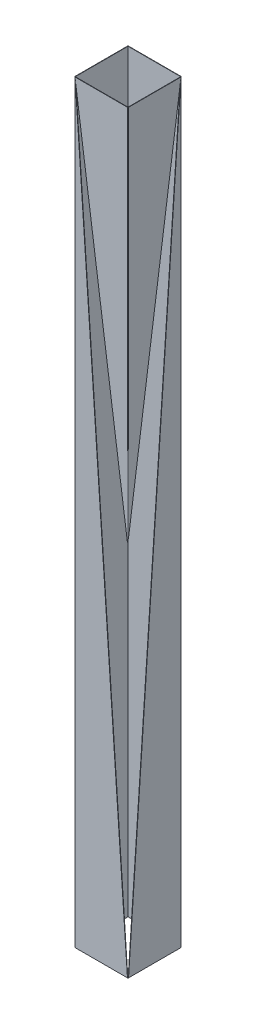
ISO-10303-21;
HEADER;
FILE_DESCRIPTION(('STEP AP214'),'2;1');
FILE_NAME('part.step','',(''),(''),'','','');
FILE_SCHEMA(('AUTOMOTIVE_DESIGN { 1 0 10303 214 1 1 1 1 }'));
ENDSEC;
DATA;
#1=APPLICATION_CONTEXT('core data for automotive mechanical design processes');
#2=APPLICATION_PROTOCOL_DEFINITION('international standard','automotive_design',2000,#1);
#3=PRODUCT_CONTEXT('',#1,'mechanical');
#4=PRODUCT('Part','Part','',(#3));
#5=PRODUCT_RELATED_PRODUCT_CATEGORY('part','',(#4));
#6=PRODUCT_DEFINITION_FORMATION('','',#4);
#7=PRODUCT_DEFINITION_CONTEXT('part definition',#1,'design');
#8=PRODUCT_DEFINITION('design','',#6,#7);
#9=PRODUCT_DEFINITION_SHAPE('','',#8);
#10=(LENGTH_UNIT() NAMED_UNIT(*) SI_UNIT(.MILLI.,.METRE.));
#11=(NAMED_UNIT(*) PLANE_ANGLE_UNIT() SI_UNIT($,.RADIAN.));
#12=(NAMED_UNIT(*) SI_UNIT($,.STERADIAN.) SOLID_ANGLE_UNIT());
#13=UNCERTAINTY_MEASURE_WITH_UNIT(LENGTH_MEASURE(1.E-05),#10,'distance_accuracy_value','');
#14=(GEOMETRIC_REPRESENTATION_CONTEXT(3) GLOBAL_UNCERTAINTY_ASSIGNED_CONTEXT((#13)) GLOBAL_UNIT_ASSIGNED_CONTEXT((#10,
#11,#12)) REPRESENTATION_CONTEXT('',''));
#15=CARTESIAN_POINT('',(0.,0.,0.));
#16=DIRECTION('',(0.,0.,1.));
#17=DIRECTION('',(1.,0.,0.));
#18=AXIS2_PLACEMENT_3D('',#15,#16,#17);
#19=CARTESIAN_POINT('',(140.,2000.,141.999999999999));
#20=DIRECTION('',(0.,0.,-1.));
#21=DIRECTION('',(-1.,0.,0.));
#22=AXIS2_PLACEMENT_3D('',#19,#20,#21);
#23=PLANE('',#22);
#24=DIRECTION('',(0.,-1.,0.));
#25=VECTOR('',#24,1.);
#26=CARTESIAN_POINT('',(139.5,2000.,141.999999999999));
#27=LINE('',#26,#25);
#28=CARTESIAN_POINT('',(139.5,0.99999999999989,141.999999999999));
#29=VERTEX_POINT('',#28);
#30=CARTESIAN_POINT('',(139.5,0.,141.999999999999));
#31=VERTEX_POINT('',#30);
#32=EDGE_CURVE('E68',#29,#31,#27,.T.);
#33=ORIENTED_EDGE('',*,*,#32,.F.);
#34=DIRECTION('',(0.0694018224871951,-0.997588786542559,0.));
#35=VECTOR('',#34,1.);
#36=CARTESIAN_POINT('',(139.5,0.999999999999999,142.));
#37=LINE('',#36,#35);
#38=CARTESIAN_POINT('',(0.499999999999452,1999.,142.));
#39=VERTEX_POINT('',#38);
#40=EDGE_CURVE('E530',#39,#29,#37,.T.);
#41=ORIENTED_EDGE('',*,*,#40,.F.);
#42=DIRECTION('',(0.,-1.,0.));
#43=VECTOR('',#42,1.);
#44=CARTESIAN_POINT('',(0.499999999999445,2000.,142.));
#45=LINE('',#44,#43);
#46=CARTESIAN_POINT('',(0.499999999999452,0.,142.));
#47=VERTEX_POINT('',#46);
#48=EDGE_CURVE('E534',#39,#47,#45,.T.);
#49=ORIENTED_EDGE('',*,*,#48,.T.);
#50=DIRECTION('',(1.,0.,0.));
#51=VECTOR('',#50,1.);
#52=CARTESIAN_POINT('',(140.,0.,141.999999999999));
#53=LINE('',#52,#51);
#54=EDGE_CURVE('E593',#47,#31,#53,.T.);
#55=ORIENTED_EDGE('',*,*,#54,.T.);
#56=EDGE_LOOP('',(#33,#41,#49,#55));
#57=FACE_BOUND('',#56,.T.);
#58=ADVANCED_FACE('F43',(#57),#23,.F.);
#59=CARTESIAN_POINT('',(140.,2000.,140.999999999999));
#60=DIRECTION('',(0.,0.,-1.));
#61=DIRECTION('',(-1.,0.,0.));
#62=AXIS2_PLACEMENT_3D('',#59,#60,#61);
#63=PLANE('',#62);
#64=DIRECTION('',(0.0694018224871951,-0.997588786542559,0.));
#65=VECTOR('',#64,1.);
#66=CARTESIAN_POINT('',(139.5,0.999999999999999,141.));
#67=LINE('',#66,#65);
#68=CARTESIAN_POINT('',(0.499999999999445,1999.,141.));
#69=VERTEX_POINT('',#68);
#70=CARTESIAN_POINT('',(139.5,0.99999999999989,140.999999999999));
#71=VERTEX_POINT('',#70);
#72=EDGE_CURVE('E546',#69,#71,#67,.T.);
#73=ORIENTED_EDGE('',*,*,#72,.T.);
#74=DIRECTION('',(0.,1.,0.));
#75=VECTOR('',#74,1.);
#76=CARTESIAN_POINT('',(139.5,0.,140.999999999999));
#77=LINE('',#76,#75);
#78=CARTESIAN_POINT('',(139.5,0.,140.999999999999));
#79=VERTEX_POINT('',#78);
#80=EDGE_CURVE('E582',#79,#71,#77,.T.);
#81=ORIENTED_EDGE('',*,*,#80,.F.);
#82=DIRECTION('',(1.,0.,0.));
#83=VECTOR('',#82,1.);
#84=CARTESIAN_POINT('',(140.,0.,140.999999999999));
#85=LINE('',#84,#83);
#86=CARTESIAN_POINT('',(0.499999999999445,0.,141.));
#87=VERTEX_POINT('',#86);
#88=EDGE_CURVE('E597',#87,#79,#85,.T.);
#89=ORIENTED_EDGE('',*,*,#88,.F.);
#90=DIRECTION('',(0.,-1.,0.));
#91=VECTOR('',#90,1.);
#92=CARTESIAN_POINT('',(0.499999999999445,2000.,141.));
#93=LINE('',#92,#91);
#94=EDGE_CURVE('E535',#69,#87,#93,.T.);
#95=ORIENTED_EDGE('',*,*,#94,.F.);
#96=EDGE_LOOP('',(#73,#81,#89,#95));
#97=FACE_BOUND('',#96,.T.);
#98=ADVANCED_FACE('F662',(#97),#63,.T.);
#99=CARTESIAN_POINT('',(-4.9960036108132E-13,2000.,142.));
#100=DIRECTION('',(0.,-1.,0.));
#101=DIRECTION('',(0.,0.,-1.));
#102=AXIS2_PLACEMENT_3D('',#99,#100,#101);
#103=PLANE('',#102);
#104=DIRECTION('',(0.,0.,1.));
#105=VECTOR('',#104,1.);
#106=CARTESIAN_POINT('',(0.499999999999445,2000.,141.));
#107=LINE('',#106,#105);
#108=CARTESIAN_POINT('',(0.499999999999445,2000.,141.));
#109=VERTEX_POINT('',#108);
#110=CARTESIAN_POINT('',(0.499999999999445,2000.,142.));
#111=VERTEX_POINT('',#110);
#112=EDGE_CURVE('E12',#109,#111,#107,.T.);
#113=ORIENTED_EDGE('',*,*,#112,.T.);
#114=DIRECTION('',(-1.,0.,0.));
#115=VECTOR('',#114,1.);
#116=CARTESIAN_POINT('',(-4.9960036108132E-13,2000.,142.));
#117=LINE('',#116,#115);
#118=CARTESIAN_POINT('',(139.5,2000.,141.999999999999));
#119=VERTEX_POINT('',#118);
#120=EDGE_CURVE('E568',#119,#111,#117,.T.);
#121=ORIENTED_EDGE('',*,*,#120,.F.);
#122=DIRECTION('',(0.,0.,1.));
#123=VECTOR('',#122,1.);
#124=CARTESIAN_POINT('',(139.5,2000.,140.999999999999));
#125=LINE('',#124,#123);
#126=CARTESIAN_POINT('',(139.5,2000.,140.999999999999));
#127=VERTEX_POINT('',#126);
#128=EDGE_CURVE('E525',#127,#119,#125,.T.);
#129=ORIENTED_EDGE('',*,*,#128,.F.);
#130=DIRECTION('',(-1.,0.,0.));
#131=VECTOR('',#130,1.);
#132=CARTESIAN_POINT('',(-4.9960036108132E-13,2000.,141.));
#133=LINE('',#132,#131);
#134=EDGE_CURVE('E545',#127,#109,#133,.T.);
#135=ORIENTED_EDGE('',*,*,#134,.T.);
#136=EDGE_LOOP('',(#113,#121,#129,#135));
#137=FACE_BOUND('',#136,.T.);
#138=ADVANCED_FACE('F45',(#137),#103,.F.);
#139=CARTESIAN_POINT('',(140.,0.,141.999999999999));
#140=DIRECTION('',(0.,1.,0.));
#141=DIRECTION('',(0.,0.,1.));
#142=AXIS2_PLACEMENT_3D('',#139,#140,#141);
#143=PLANE('',#142);
#144=DIRECTION('',(0.,0.,1.));
#145=VECTOR('',#144,1.);
#146=CARTESIAN_POINT('',(0.499999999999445,0.,141.));
#147=LINE('',#146,#145);
#148=EDGE_CURVE('E533',#87,#47,#147,.T.);
#149=ORIENTED_EDGE('',*,*,#148,.F.);
#150=ORIENTED_EDGE('',*,*,#88,.T.);
#151=DIRECTION('',(0.,0.,1.));
#152=VECTOR('',#151,1.);
#153=CARTESIAN_POINT('',(139.5,0.,140.999999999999));
#154=LINE('',#153,#152);
#155=EDGE_CURVE('E539',#79,#31,#154,.T.);
#156=ORIENTED_EDGE('',*,*,#155,.T.);
#157=ORIENTED_EDGE('',*,*,#54,.F.);
#158=EDGE_LOOP('',(#149,#150,#156,#157));
#159=FACE_BOUND('',#158,.T.);
#160=ADVANCED_FACE('F697',(#159),#143,.F.);
#161=DIRECTION('',(0.,-1.,0.));
#162=VECTOR('',#161,1.);
#163=CARTESIAN_POINT('',(0.499999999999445,2000.,142.));
#164=LINE('',#163,#162);
#165=EDGE_CURVE('E52',#111,#39,#164,.T.);
#166=ORIENTED_EDGE('',*,*,#165,.T.);
#167=DIRECTION('',(-0.137811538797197,0.990458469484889,0.));
#168=VECTOR('',#167,1.);
#169=CARTESIAN_POINT('',(139.5,1000.,142.));
#170=LINE('',#169,#168);
#171=CARTESIAN_POINT('',(139.5,1000.,142.));
#172=VERTEX_POINT('',#171);
#173=EDGE_CURVE('E351',#172,#39,#170,.T.);
#174=ORIENTED_EDGE('',*,*,#173,.F.);
#175=DIRECTION('',(0.,-1.,0.));
#176=VECTOR('',#175,1.);
#177=CARTESIAN_POINT('',(139.5,2000.,141.999999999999));
#178=LINE('',#177,#176);
#179=EDGE_CURVE('E516',#119,#172,#178,.T.);
#180=ORIENTED_EDGE('',*,*,#179,.F.);
#181=ORIENTED_EDGE('',*,*,#120,.T.);
#182=EDGE_LOOP('',(#166,#174,#180,#181));
#183=FACE_BOUND('',#182,.T.);
#184=ADVANCED_FACE('F507',(#183),#23,.F.);
#185=DIRECTION('',(-0.137811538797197,0.990458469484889,0.));
#186=VECTOR('',#185,1.);
#187=CARTESIAN_POINT('',(139.5,1000.,141.));
#188=LINE('',#187,#186);
#189=CARTESIAN_POINT('',(139.5,1000.,141.));
#190=VERTEX_POINT('',#189);
#191=EDGE_CURVE('E551',#190,#69,#188,.T.);
#192=ORIENTED_EDGE('',*,*,#191,.T.);
#193=DIRECTION('',(0.,-1.,0.));
#194=VECTOR('',#193,1.);
#195=CARTESIAN_POINT('',(0.499999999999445,2000.,141.));
#196=LINE('',#195,#194);
#197=EDGE_CURVE('E537',#109,#69,#196,.T.);
#198=ORIENTED_EDGE('',*,*,#197,.F.);
#199=ORIENTED_EDGE('',*,*,#134,.F.);
#200=DIRECTION('',(0.,1.,0.));
#201=VECTOR('',#200,1.);
#202=CARTESIAN_POINT('',(139.5,0.,140.999999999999));
#203=LINE('',#202,#201);
#204=EDGE_CURVE('E590',#190,#127,#203,.T.);
#205=ORIENTED_EDGE('',*,*,#204,.F.);
#206=EDGE_LOOP('',(#192,#198,#199,#205));
#207=FACE_BOUND('',#206,.T.);
#208=ADVANCED_FACE('F501',(#207),#63,.T.);
#209=CARTESIAN_POINT('',(139.5,0.999999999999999,141.));
#210=DIRECTION('',(-0.997588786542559,-0.0694018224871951,0.));
#211=DIRECTION('',(-0.0694018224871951,0.997588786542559,0.));
#212=AXIS2_PLACEMENT_3D('',#209,#210,#211);
#213=PLANE('',#212);
#214=ORIENTED_EDGE('',*,*,#40,.T.);
#215=DIRECTION('',(0.,0.,1.));
#216=VECTOR('',#215,1.);
#217=CARTESIAN_POINT('',(139.5,0.999999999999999,141.));
#218=LINE('',#217,#216);
#219=EDGE_CURVE('E601',#71,#29,#218,.T.);
#220=ORIENTED_EDGE('',*,*,#219,.F.);
#221=ORIENTED_EDGE('',*,*,#72,.F.);
#222=DIRECTION('',(0.,0.,1.));
#223=VECTOR('',#222,1.);
#224=CARTESIAN_POINT('',(0.499999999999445,1999.,141.));
#225=LINE('',#224,#223);
#226=EDGE_CURVE('E542',#69,#39,#225,.T.);
#227=ORIENTED_EDGE('',*,*,#226,.T.);
#228=EDGE_LOOP('',(#214,#220,#221,#227));
#229=FACE_BOUND('',#228,.T.);
#230=ADVANCED_FACE('F497',(#229),#213,.F.);
#231=CARTESIAN_POINT('',(139.5,1000.,141.));
#232=DIRECTION('',(0.990458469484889,0.137811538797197,0.));
#233=DIRECTION('',(0.137811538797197,-0.990458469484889,0.));
#234=AXIS2_PLACEMENT_3D('',#231,#232,#233);
#235=PLANE('',#234);
#236=ORIENTED_EDGE('',*,*,#173,.T.);
#237=ORIENTED_EDGE('',*,*,#226,.F.);
#238=ORIENTED_EDGE('',*,*,#191,.F.);
#239=CARTESIAN_POINT('',(139.5,1000.,141.999999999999));
#240=CARTESIAN_POINT('',(139.5,1000.,140.999999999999));
#241=B_SPLINE_CURVE_WITH_KNOTS('',1,(#239,#240),.UNSPECIFIED.,.F.,.F.,(2,2),(0.,1.),.UNSPECIFIED.);
#242=EDGE_CURVE('E524',#190,#172,#241,.F.);
#243=ORIENTED_EDGE('',*,*,#242,.T.);
#244=EDGE_LOOP('',(#236,#237,#238,#243));
#245=FACE_BOUND('',#244,.T.);
#246=ADVANCED_FACE('F500',(#245),#235,.F.);
#247=CARTESIAN_POINT('',(0.,0.,1.));
#248=DIRECTION('',(1.,0.,0.));
#249=DIRECTION('',(0.,0.,-1.));
#250=AXIS2_PLACEMENT_3D('',#247,#248,#249);
#251=PLANE('',#250);
#252=DIRECTION('',(0.,-1.,0.));
#253=VECTOR('',#252,1.);
#254=CARTESIAN_POINT('',(0.,0.,0.));
#255=LINE('',#254,#253);
#256=CARTESIAN_POINT('',(0.,2000.,0.));
#257=VERTEX_POINT('',#256);
#258=CARTESIAN_POINT('',(0.,0.,0.));
#259=VERTEX_POINT('',#258);
#260=EDGE_CURVE('E459',#257,#259,#255,.T.);
#261=ORIENTED_EDGE('',*,*,#260,.T.);
#262=DIRECTION('',(0.,0.,-1.));
#263=VECTOR('',#262,1.);
#264=CARTESIAN_POINT('',(0.,0.,1.));
#265=LINE('',#264,#263);
#266=CARTESIAN_POINT('',(0.,0.,1.));
#267=VERTEX_POINT('',#266);
#268=EDGE_CURVE('E453',#267,#259,#265,.T.);
#269=ORIENTED_EDGE('',*,*,#268,.F.);
#270=DIRECTION('',(0.,-1.,0.));
#271=VECTOR('',#270,1.);
#272=CARTESIAN_POINT('',(0.,0.,1.));
#273=LINE('',#272,#271);
#274=CARTESIAN_POINT('',(0.,2000.,1.));
#275=VERTEX_POINT('',#274);
#276=EDGE_CURVE('E437',#275,#267,#273,.T.);
#277=ORIENTED_EDGE('',*,*,#276,.F.);
#278=DIRECTION('',(0.,0.,-1.));
#279=VECTOR('',#278,1.);
#280=CARTESIAN_POINT('',(0.,2000.,1.));
#281=LINE('',#280,#279);
#282=EDGE_CURVE('E456',#275,#257,#281,.T.);
#283=ORIENTED_EDGE('',*,*,#282,.T.);
#284=EDGE_LOOP('',(#261,#269,#277,#283));
#285=FACE_BOUND('',#284,.T.);
#286=ADVANCED_FACE('F315',(#285),#251,.F.);
#287=CARTESIAN_POINT('',(0.,0.,1.));
#288=DIRECTION('',(0.,1.,0.));
#289=DIRECTION('',(0.,0.,1.));
#290=AXIS2_PLACEMENT_3D('',#287,#288,#289);
#291=PLANE('',#290);
#292=DIRECTION('',(0.,0.,-1.));
#293=VECTOR('',#292,1.);
#294=CARTESIAN_POINT('',(139.5,0.,1.));
#295=LINE('',#294,#293);
#296=CARTESIAN_POINT('',(139.5,0.,1.));
#297=VERTEX_POINT('',#296);
#298=CARTESIAN_POINT('',(139.5,0.,0.));
#299=VERTEX_POINT('',#298);
#300=EDGE_CURVE('E427',#297,#299,#295,.T.);
#301=ORIENTED_EDGE('',*,*,#300,.F.);
#302=DIRECTION('',(1.,0.,0.));
#303=VECTOR('',#302,1.);
#304=CARTESIAN_POINT('',(0.,0.,1.));
#305=LINE('',#304,#303);
#306=EDGE_CURVE('E434',#267,#297,#305,.T.);
#307=ORIENTED_EDGE('',*,*,#306,.F.);
#308=ORIENTED_EDGE('',*,*,#268,.T.);
#309=DIRECTION('',(1.,0.,0.));
#310=VECTOR('',#309,1.);
#311=CARTESIAN_POINT('',(0.,0.,0.));
#312=LINE('',#311,#310);
#313=EDGE_CURVE('E450',#259,#299,#312,.T.);
#314=ORIENTED_EDGE('',*,*,#313,.T.);
#315=EDGE_LOOP('',(#301,#307,#308,#314));
#316=FACE_BOUND('',#315,.T.);
#317=ADVANCED_FACE('F945',(#316),#291,.F.);
#318=CARTESIAN_POINT('',(0.,2000.,0.));
#319=DIRECTION('',(0.,0.,-1.));
#320=DIRECTION('',(-1.,0.,0.));
#321=AXIS2_PLACEMENT_3D('',#318,#319,#320);
#322=PLANE('',#321);
#323=DIRECTION('',(-1.,0.,0.));
#324=VECTOR('',#323,1.);
#325=CARTESIAN_POINT('',(0.,2000.,0.));
#326=LINE('',#325,#324);
#327=CARTESIAN_POINT('',(139.5,2000.,0.));
#328=VERTEX_POINT('',#327);
#329=EDGE_CURVE('E442',#328,#257,#326,.T.);
#330=ORIENTED_EDGE('',*,*,#329,.F.);
#331=DIRECTION('',(0.,-1.,0.));
#332=VECTOR('',#331,1.);
#333=CARTESIAN_POINT('',(139.5,2000.,0.));
#334=LINE('',#333,#332);
#335=EDGE_CURVE('E447',#328,#299,#334,.T.);
#336=ORIENTED_EDGE('',*,*,#335,.T.);
#337=ORIENTED_EDGE('',*,*,#313,.F.);
#338=ORIENTED_EDGE('',*,*,#260,.F.);
#339=EDGE_LOOP('',(#330,#336,#337,#338));
#340=FACE_BOUND('',#339,.T.);
#341=ADVANCED_FACE('F935',(#340),#322,.T.);
#342=CARTESIAN_POINT('',(0.,2000.,1.));
#343=DIRECTION('',(0.,-1.,0.));
#344=DIRECTION('',(0.,0.,-1.));
#345=AXIS2_PLACEMENT_3D('',#342,#343,#344);
#346=PLANE('',#345);
#347=DIRECTION('',(0.,0.,-1.));
#348=VECTOR('',#347,1.);
#349=CARTESIAN_POINT('',(139.5,2000.,1.));
#350=LINE('',#349,#348);
#351=CARTESIAN_POINT('',(139.5,2000.,1.));
#352=VERTEX_POINT('',#351);
#353=EDGE_CURVE('E444',#352,#328,#350,.T.);
#354=ORIENTED_EDGE('',*,*,#353,.T.);
#355=ORIENTED_EDGE('',*,*,#329,.T.);
#356=ORIENTED_EDGE('',*,*,#282,.F.);
#357=DIRECTION('',(-1.,0.,0.));
#358=VECTOR('',#357,1.);
#359=CARTESIAN_POINT('',(0.,2000.,1.));
#360=LINE('',#359,#358);
#361=EDGE_CURVE('E440',#352,#275,#360,.T.);
#362=ORIENTED_EDGE('',*,*,#361,.F.);
#363=EDGE_LOOP('',(#354,#355,#356,#362));
#364=FACE_BOUND('',#363,.T.);
#365=ADVANCED_FACE('F925',(#364),#346,.F.);
#366=CARTESIAN_POINT('',(0.,2000.,1.));
#367=DIRECTION('',(0.,0.,-1.));
#368=DIRECTION('',(-1.,0.,0.));
#369=AXIS2_PLACEMENT_3D('',#366,#367,#368);
#370=PLANE('',#369);
#371=DIRECTION('',(0.,-1.,0.));
#372=VECTOR('',#371,1.);
#373=CARTESIAN_POINT('',(139.5,2000.,1.));
#374=LINE('',#373,#372);
#375=EDGE_CURVE('E412',#352,#297,#374,.T.);
#376=ORIENTED_EDGE('',*,*,#375,.F.);
#377=ORIENTED_EDGE('',*,*,#361,.T.);
#378=ORIENTED_EDGE('',*,*,#276,.T.);
#379=ORIENTED_EDGE('',*,*,#306,.T.);
#380=EDGE_LOOP('',(#376,#377,#378,#379));
#381=FACE_BOUND('',#380,.T.);
#382=ADVANCED_FACE('F916',(#381),#370,.F.);
#383=CARTESIAN_POINT('',(139.5,0.,1.5));
#384=DIRECTION('',(0.,1.,0.));
#385=DIRECTION('',(0.,0.,1.));
#386=AXIS2_PLACEMENT_3D('',#383,#384,#385);
#387=PLANE('',#386);
#388=CARTESIAN_POINT('',(139.5,0.,1.5));
#389=DIRECTION('',(0.,1.,0.));
#390=DIRECTION('',(0.,0.,1.));
#391=AXIS2_PLACEMENT_3D('',#388,#389,#390);
#392=CIRCLE('',#391,1.5);
#393=CARTESIAN_POINT('',(140.999999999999,0.,1.499999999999));
#394=VERTEX_POINT('',#393);
#395=EDGE_CURVE('E431',#299,#394,#392,.F.);
#396=ORIENTED_EDGE('',*,*,#395,.T.);
#397=DIRECTION('',(1.,0.,0.));
#398=VECTOR('',#397,1.);
#399=CARTESIAN_POINT('',(139.999999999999,0.,1.499999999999));
#400=LINE('',#399,#398);
#401=CARTESIAN_POINT('',(139.999999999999,0.,1.499999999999));
#402=VERTEX_POINT('',#401);
#403=EDGE_CURVE('E343',#402,#394,#400,.T.);
#404=ORIENTED_EDGE('',*,*,#403,.F.);
#405=CARTESIAN_POINT('',(139.5,0.,1.5));
#406=DIRECTION('',(0.,-1.,0.));
#407=DIRECTION('',(0.,0.,-1.));
#408=AXIS2_PLACEMENT_3D('',#405,#406,#407);
#409=CIRCLE('',#408,0.5);
#410=EDGE_CURVE('E407',#297,#402,#409,.T.);
#411=ORIENTED_EDGE('',*,*,#410,.F.);
#412=ORIENTED_EDGE('',*,*,#300,.T.);
#413=EDGE_LOOP('',(#396,#404,#411,#412));
#414=FACE_BOUND('',#413,.T.);
#415=ADVANCED_FACE('F649',(#414),#387,.F.);
#416=CARTESIAN_POINT('',(139.5,-1000.00086685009,1.5));
#417=DIRECTION('',(0.,1.,0.));
#418=DIRECTION('',(0.,0.,1.));
#419=AXIS2_PLACEMENT_3D('',#416,#417,#418);
#420=CYLINDRICAL_SURFACE('',#419,1.5);
#421=ORIENTED_EDGE('',*,*,#335,.F.);
#422=CARTESIAN_POINT('',(139.5,2000.,1.5));
#423=DIRECTION('',(0.,1.,0.));
#424=DIRECTION('',(0.,0.,1.));
#425=AXIS2_PLACEMENT_3D('',#422,#423,#424);
#426=CIRCLE('',#425,1.5);
#427=CARTESIAN_POINT('',(140.999999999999,2000.,1.499999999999));
#428=VERTEX_POINT('',#427);
#429=EDGE_CURVE('E414',#428,#328,#426,.T.);
#430=ORIENTED_EDGE('',*,*,#429,.F.);
#431=DIRECTION('',(0.,-1.,0.));
#432=VECTOR('',#431,1.);
#433=CARTESIAN_POINT('',(140.999999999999,0.,1.499999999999));
#434=LINE('',#433,#432);
#435=CARTESIAN_POINT('',(141.,1999.,1.499999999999));
#436=VERTEX_POINT('',#435);
#437=EDGE_CURVE('E422',#428,#436,#434,.T.);
#438=ORIENTED_EDGE('',*,*,#437,.T.);
#439=DIRECTION('',(0.,-1.,0.));
#440=VECTOR('',#439,1.);
#441=CARTESIAN_POINT('',(140.999999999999,0.,1.499999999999));
#442=LINE('',#441,#440);
#443=EDGE_CURVE('E419',#436,#394,#442,.T.);
#444=ORIENTED_EDGE('',*,*,#443,.T.);
#445=ORIENTED_EDGE('',*,*,#395,.F.);
#446=EDGE_LOOP('',(#421,#430,#438,#444,#445));
#447=FACE_BOUND('',#446,.T.);
#448=ADVANCED_FACE('F630',(#447),#420,.T.);
#449=CARTESIAN_POINT('',(139.5,2000.,1.5));
#450=DIRECTION('',(0.,-1.,0.));
#451=DIRECTION('',(0.,0.,-1.));
#452=AXIS2_PLACEMENT_3D('',#449,#450,#451);
#453=PLANE('',#452);
#454=DIRECTION('',(1.,0.,0.));
#455=VECTOR('',#454,1.);
#456=CARTESIAN_POINT('',(139.999999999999,2000.,1.499999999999));
#457=LINE('',#456,#455);
#458=CARTESIAN_POINT('',(140.,2000.,1.5));
#459=VERTEX_POINT('',#458);
#460=EDGE_CURVE('E416',#459,#428,#457,.T.);
#461=ORIENTED_EDGE('',*,*,#460,.T.);
#462=ORIENTED_EDGE('',*,*,#429,.T.);
#463=ORIENTED_EDGE('',*,*,#353,.F.);
#464=CARTESIAN_POINT('',(139.5,2000.,1.5));
#465=DIRECTION('',(0.,1.,0.));
#466=DIRECTION('',(0.,0.,1.));
#467=AXIS2_PLACEMENT_3D('',#464,#465,#466);
#468=CIRCLE('',#467,0.5);
#469=EDGE_CURVE('E394',#459,#352,#468,.T.);
#470=ORIENTED_EDGE('',*,*,#469,.F.);
#471=EDGE_LOOP('',(#461,#462,#463,#470));
#472=FACE_BOUND('',#471,.T.);
#473=ADVANCED_FACE('F634',(#472),#453,.F.);
#474=CARTESIAN_POINT('',(139.5,-1000.00086685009,1.5));
#475=DIRECTION('',(0.,1.,0.));
#476=DIRECTION('',(0.,0.,1.));
#477=AXIS2_PLACEMENT_3D('',#474,#475,#476);
#478=CYLINDRICAL_SURFACE('',#477,0.5);
#479=ORIENTED_EDGE('',*,*,#375,.T.);
#480=ORIENTED_EDGE('',*,*,#410,.T.);
#481=DIRECTION('',(0.,1.,0.));
#482=VECTOR('',#481,1.);
#483=CARTESIAN_POINT('',(139.999999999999,0.,1.499999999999));
#484=LINE('',#483,#482);
#485=CARTESIAN_POINT('',(140.,1999.,1.499999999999));
#486=VERTEX_POINT('',#485);
#487=EDGE_CURVE('E402',#402,#486,#484,.T.);
#488=ORIENTED_EDGE('',*,*,#487,.T.);
#489=DIRECTION('',(0.,1.,0.));
#490=VECTOR('',#489,1.);
#491=CARTESIAN_POINT('',(139.999999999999,0.,1.499999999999));
#492=LINE('',#491,#490);
#493=EDGE_CURVE('E399',#486,#459,#492,.T.);
#494=ORIENTED_EDGE('',*,*,#493,.T.);
#495=ORIENTED_EDGE('',*,*,#469,.T.);
#496=EDGE_LOOP('',(#479,#480,#488,#494,#495));
#497=FACE_BOUND('',#496,.T.);
#498=ADVANCED_FACE('F638',(#497),#478,.F.);
#499=CARTESIAN_POINT('',(140.,0.,140.999999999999));
#500=DIRECTION('',(-1.,0.,0.));
#501=DIRECTION('',(0.,0.,1.));
#502=AXIS2_PLACEMENT_3D('',#499,#500,#501);
#503=PLANE('',#502);
#504=DIRECTION('',(0.,0.997588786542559,-0.0694018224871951));
#505=VECTOR('',#504,1.);
#506=CARTESIAN_POINT('',(140.,1999.,1.499999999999));
#507=LINE('',#506,#505);
#508=CARTESIAN_POINT('',(140.,0.99999999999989,140.499999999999));
#509=VERTEX_POINT('',#508);
#510=EDGE_CURVE('E390',#509,#486,#507,.T.);
#511=ORIENTED_EDGE('',*,*,#510,.T.);
#512=ORIENTED_EDGE('',*,*,#487,.F.);
#513=DIRECTION('',(0.,0.,-1.));
#514=VECTOR('',#513,1.);
#515=CARTESIAN_POINT('',(139.999999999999,0.,0.999999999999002));
#516=LINE('',#515,#514);
#517=CARTESIAN_POINT('',(140.,0.,140.499999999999));
#518=VERTEX_POINT('',#517);
#519=EDGE_CURVE('E352',#518,#402,#516,.T.);
#520=ORIENTED_EDGE('',*,*,#519,.F.);
#521=DIRECTION('',(0.,-1.,0.));
#522=VECTOR('',#521,1.);
#523=CARTESIAN_POINT('',(140.,2000.,140.499999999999));
#524=LINE('',#523,#522);
#525=EDGE_CURVE('E253',#509,#518,#524,.T.);
#526=ORIENTED_EDGE('',*,*,#525,.F.);
#527=EDGE_LOOP('',(#511,#512,#520,#526));
#528=FACE_BOUND('',#527,.T.);
#529=ADVANCED_FACE('F645',(#528),#503,.T.);
#530=DIRECTION('',(0.,-0.990244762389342,0.139338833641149));
#531=VECTOR('',#530,1.);
#532=CARTESIAN_POINT('',(140.000000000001,1000.,142.070796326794));
#533=LINE('',#532,#531);
#534=CARTESIAN_POINT('',(140.,1011.16323995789,140.499999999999));
#535=VERTEX_POINT('',#534);
#536=EDGE_CURVE('E387',#486,#535,#533,.T.);
#537=ORIENTED_EDGE('',*,*,#536,.T.);
#538=DIRECTION('',(0.,-1.,0.));
#539=VECTOR('',#538,1.);
#540=CARTESIAN_POINT('',(140.,2000.,140.499999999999));
#541=LINE('',#540,#539);
#542=CARTESIAN_POINT('',(140.,2000.,140.499999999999));
#543=VERTEX_POINT('',#542);
#544=EDGE_CURVE('E464',#543,#535,#541,.T.);
#545=ORIENTED_EDGE('',*,*,#544,.F.);
#546=DIRECTION('',(0.,0.,1.));
#547=VECTOR('',#546,1.);
#548=CARTESIAN_POINT('',(140.,2000.,140.999999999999));
#549=LINE('',#548,#547);
#550=EDGE_CURVE('E381',#459,#543,#549,.T.);
#551=ORIENTED_EDGE('',*,*,#550,.F.);
#552=ORIENTED_EDGE('',*,*,#493,.F.);
#553=EDGE_LOOP('',(#537,#545,#551,#552));
#554=FACE_BOUND('',#553,.T.);
#555=ADVANCED_FACE('F617',(#554),#503,.T.);
#556=CARTESIAN_POINT('',(141.,2000.,140.999999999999));
#557=DIRECTION('',(0.,-1.,0.));
#558=DIRECTION('',(0.,0.,-1.));
#559=AXIS2_PLACEMENT_3D('',#556,#557,#558);
#560=PLANE('',#559);
#561=DIRECTION('',(1.,0.,0.));
#562=VECTOR('',#561,1.);
#563=CARTESIAN_POINT('',(140.,2000.,140.499999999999));
#564=LINE('',#563,#562);
#565=CARTESIAN_POINT('',(141.,2000.,140.499999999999));
#566=VERTEX_POINT('',#565);
#567=EDGE_CURVE('E384',#543,#566,#564,.T.);
#568=ORIENTED_EDGE('',*,*,#567,.T.);
#569=DIRECTION('',(0.,0.,1.));
#570=VECTOR('',#569,1.);
#571=CARTESIAN_POINT('',(141.,2000.,140.999999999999));
#572=LINE('',#571,#570);
#573=EDGE_CURVE('E375',#428,#566,#572,.T.);
#574=ORIENTED_EDGE('',*,*,#573,.F.);
#575=ORIENTED_EDGE('',*,*,#460,.F.);
#576=ORIENTED_EDGE('',*,*,#550,.T.);
#577=EDGE_LOOP('',(#568,#574,#575,#576));
#578=FACE_BOUND('',#577,.T.);
#579=ADVANCED_FACE('F636',(#578),#560,.F.);
#580=CARTESIAN_POINT('',(141.,0.,140.999999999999));
#581=DIRECTION('',(-1.,0.,0.));
#582=DIRECTION('',(0.,0.,1.));
#583=AXIS2_PLACEMENT_3D('',#580,#581,#582);
#584=PLANE('',#583);
#585=DIRECTION('',(0.,-1.,0.));
#586=VECTOR('',#585,1.);
#587=CARTESIAN_POINT('',(141.,2000.,140.499999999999));
#588=LINE('',#587,#586);
#589=CARTESIAN_POINT('',(141.,1011.16323995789,140.499999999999));
#590=VERTEX_POINT('',#589);
#591=EDGE_CURVE('E380',#566,#590,#588,.T.);
#592=ORIENTED_EDGE('',*,*,#591,.T.);
#593=DIRECTION('',(0.,-0.990244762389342,0.139338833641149));
#594=VECTOR('',#593,1.);
#595=CARTESIAN_POINT('',(141.000000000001,1000.,142.070796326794));
#596=LINE('',#595,#594);
#597=EDGE_CURVE('E365',#436,#590,#596,.T.);
#598=ORIENTED_EDGE('',*,*,#597,.F.);
#599=ORIENTED_EDGE('',*,*,#437,.F.);
#600=ORIENTED_EDGE('',*,*,#573,.T.);
#601=EDGE_LOOP('',(#592,#598,#599,#600));
#602=FACE_BOUND('',#601,.T.);
#603=ADVANCED_FACE('F488',(#602),#584,.F.);
#604=CARTESIAN_POINT('',(140.000000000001,1000.,142.070796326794));
#605=DIRECTION('',(0.,0.139338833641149,0.990244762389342));
#606=DIRECTION('',(0.,0.990244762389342,-0.139338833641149));
#607=AXIS2_PLACEMENT_3D('',#604,#605,#606);
#608=PLANE('',#607);
#609=CARTESIAN_POINT('',(140.,1011.16323995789,140.499999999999));
#610=CARTESIAN_POINT('',(141.,1011.16323995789,140.499999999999));
#611=B_SPLINE_CURVE_WITH_KNOTS('',1,(#609,#610),.UNSPECIFIED.,.F.,.F.,(2,2),(0.,1.),.UNSPECIFIED.);
#612=EDGE_CURVE('E339',#535,#590,#611,.T.);
#613=ORIENTED_EDGE('',*,*,#612,.F.);
#614=ORIENTED_EDGE('',*,*,#536,.F.);
#615=DIRECTION('',(1.,0.,0.));
#616=VECTOR('',#615,1.);
#617=CARTESIAN_POINT('',(140.,1999.,1.499999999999));
#618=LINE('',#617,#616);
#619=EDGE_CURVE('E370',#486,#436,#618,.T.);
#620=ORIENTED_EDGE('',*,*,#619,.T.);
#621=ORIENTED_EDGE('',*,*,#597,.T.);
#622=EDGE_LOOP('',(#613,#614,#620,#621));
#623=FACE_BOUND('',#622,.T.);
#624=ADVANCED_FACE('F477',(#623),#608,.F.);
#625=CARTESIAN_POINT('',(140.,1999.,1.499999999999));
#626=DIRECTION('',(0.,-0.0694018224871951,-0.997588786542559));
#627=DIRECTION('',(0.,-0.997588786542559,0.0694018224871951));
#628=AXIS2_PLACEMENT_3D('',#625,#626,#627);
#629=PLANE('',#628);
#630=DIRECTION('',(0.,0.997588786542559,-0.0694018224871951));
#631=VECTOR('',#630,1.);
#632=CARTESIAN_POINT('',(141.,1999.,1.499999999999));
#633=LINE('',#632,#631);
#634=CARTESIAN_POINT('',(141.000000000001,0.99999999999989,140.499999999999));
#635=VERTEX_POINT('',#634);
#636=EDGE_CURVE('E362',#635,#436,#633,.T.);
#637=ORIENTED_EDGE('',*,*,#636,.T.);
#638=ORIENTED_EDGE('',*,*,#619,.F.);
#639=ORIENTED_EDGE('',*,*,#510,.F.);
#640=DIRECTION('',(1.,0.,0.));
#641=VECTOR('',#640,1.);
#642=CARTESIAN_POINT('',(140.000000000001,0.99999999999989,140.499999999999));
#643=LINE('',#642,#641);
#644=EDGE_CURVE('E359',#509,#635,#643,.T.);
#645=ORIENTED_EDGE('',*,*,#644,.T.);
#646=EDGE_LOOP('',(#637,#638,#639,#645));
#647=FACE_BOUND('',#646,.T.);
#648=ADVANCED_FACE('F487',(#647),#629,.F.);
#649=ORIENTED_EDGE('',*,*,#443,.F.);
#650=ORIENTED_EDGE('',*,*,#636,.F.);
#651=DIRECTION('',(0.,-1.,0.));
#652=VECTOR('',#651,1.);
#653=CARTESIAN_POINT('',(141.,2000.,140.499999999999));
#654=LINE('',#653,#652);
#655=CARTESIAN_POINT('',(141.,0.,140.499999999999));
#656=VERTEX_POINT('',#655);
#657=EDGE_CURVE('E356',#635,#656,#654,.T.);
#658=ORIENTED_EDGE('',*,*,#657,.T.);
#659=DIRECTION('',(0.,0.,-1.));
#660=VECTOR('',#659,1.);
#661=CARTESIAN_POINT('',(140.999999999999,0.,0.999999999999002));
#662=LINE('',#661,#660);
#663=EDGE_CURVE('E354',#656,#394,#662,.T.);
#664=ORIENTED_EDGE('',*,*,#663,.T.);
#665=EDGE_LOOP('',(#649,#650,#658,#664));
#666=FACE_BOUND('',#665,.T.);
#667=ADVANCED_FACE('F489',(#666),#584,.F.);
#668=CARTESIAN_POINT('',(140.999999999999,0.,0.999999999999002));
#669=DIRECTION('',(0.,1.,0.));
#670=DIRECTION('',(0.,0.,1.));
#671=AXIS2_PLACEMENT_3D('',#668,#669,#670);
#672=PLANE('',#671);
#673=DIRECTION('',(1.,0.,0.));
#674=VECTOR('',#673,1.);
#675=CARTESIAN_POINT('',(140.,0.,140.499999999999));
#676=LINE('',#675,#674);
#677=EDGE_CURVE('E462',#518,#656,#676,.T.);
#678=ORIENTED_EDGE('',*,*,#677,.F.);
#679=ORIENTED_EDGE('',*,*,#519,.T.);
#680=ORIENTED_EDGE('',*,*,#403,.T.);
#681=ORIENTED_EDGE('',*,*,#663,.F.);
#682=EDGE_LOOP('',(#678,#679,#680,#681));
#683=FACE_BOUND('',#682,.T.);
#684=ADVANCED_FACE('F314',(#683),#672,.F.);
#685=CARTESIAN_POINT('',(141.,1011.16323995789,140.499999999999));
#686=CARTESIAN_POINT('',(141.,1010.23296280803,140.696351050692));
#687=CARTESIAN_POINT('',(140.960959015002,1009.30269996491,140.892621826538));
#688=CARTESIAN_POINT('',(140.810679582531,1007.44215997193,141.255428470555));
#689=CARTESIAN_POINT('',(140.699500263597,1006.51188997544,141.421820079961));
#690=CARTESIAN_POINT('',(140.421820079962,1004.65134998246,141.699500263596));
#691=CARTESIAN_POINT('',(140.255428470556,1003.72107998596,141.81067958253));
#692=CARTESIAN_POINT('',(139.892621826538,1001.86053999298,141.960959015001));
#693=CARTESIAN_POINT('',(139.696351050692,1000.93027714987,141.999999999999));
#694=CARTESIAN_POINT('',(139.5,1000.,141.999999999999));
#695=CARTESIAN_POINT('',(140.,1011.16323995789,140.499999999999));
#696=CARTESIAN_POINT('',(140.,1010.23296913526,140.565449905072));
#697=CARTESIAN_POINT('',(139.986986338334,1009.30269996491,140.630873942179));
#698=CARTESIAN_POINT('',(139.936893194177,1007.44215997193,140.751809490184));
#699=CARTESIAN_POINT('',(139.899833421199,1006.51188997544,140.807273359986));
#700=CARTESIAN_POINT('',(139.807273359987,1004.65134998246,140.899833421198));
#701=CARTESIAN_POINT('',(139.751809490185,1003.72107998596,140.936893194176));
#702=CARTESIAN_POINT('',(139.630873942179,1001.86053999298,140.986986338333));
#703=CARTESIAN_POINT('',(139.565449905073,1000.93027082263,140.999999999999));
#704=CARTESIAN_POINT('',(139.5,1000.,140.999999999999));
#705=B_SPLINE_SURFACE_WITH_KNOTS('',1,3,((#685,#686,#687,#688,#689,#690,#691,#692,#693,#694),
(#695,#696,#697,#698,#699,#700,#701,#702,#703,#704)),.UNSPECIFIED.,.F.,.F.,.F.,(2,2),(4,2,2,2,
4),(0.,1.),(0.,0.25,0.5,0.75,1.),.UNSPECIFIED.);
#706=CARTESIAN_POINT('',(141.,1011.16323995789,140.499999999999));
#707=CARTESIAN_POINT('',(141.,1010.23296280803,140.696351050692));
#708=CARTESIAN_POINT('',(140.960959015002,1009.30269996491,140.892621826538));
#709=CARTESIAN_POINT('',(140.810679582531,1007.44215997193,141.255428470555));
#710=CARTESIAN_POINT('',(140.699500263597,1006.51188997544,141.421820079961));
#711=CARTESIAN_POINT('',(140.421820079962,1004.65134998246,141.699500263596));
#712=CARTESIAN_POINT('',(140.255428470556,1003.72107998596,141.81067958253));
#713=CARTESIAN_POINT('',(139.892621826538,1001.86053999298,141.960959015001));
#714=CARTESIAN_POINT('',(139.696351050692,1000.93027714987,141.999999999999));
#715=CARTESIAN_POINT('',(139.5,1000.,141.999999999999));
#716=B_SPLINE_CURVE_WITH_KNOTS('',3,(#706,#707,#708,#709,#710,#711,#712,#713,#714,#715),
.UNSPECIFIED.,.F.,.F.,(4,2,2,2,4),(0.,0.25,0.5,0.75,1.),.UNSPECIFIED.);
#717=EDGE_CURVE('E247',#590,#172,#716,.T.);
#718=CARTESIAN_POINT('',(139.5,1000.,140.999999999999));
#719=CARTESIAN_POINT('',(139.565449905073,1000.93027082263,140.999999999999));
#720=CARTESIAN_POINT('',(139.630873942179,1001.86053999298,140.986986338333));
#721=CARTESIAN_POINT('',(139.751809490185,1003.72107998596,140.936893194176));
#722=CARTESIAN_POINT('',(139.807273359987,1004.65134998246,140.899833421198));
#723=CARTESIAN_POINT('',(139.899833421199,1006.51188997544,140.807273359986));
#724=CARTESIAN_POINT('',(139.936893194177,1007.44215997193,140.751809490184));
#725=CARTESIAN_POINT('',(139.986986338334,1009.30269996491,140.630873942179));
#726=CARTESIAN_POINT('',(140.,1010.23296913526,140.565449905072));
#727=CARTESIAN_POINT('',(140.,1011.16323995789,140.499999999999));
#728=B_SPLINE_CURVE_WITH_KNOTS('',3,(#718,#719,#720,#721,#722,#723,#724,#725,#726,#727),
.UNSPECIFIED.,.F.,.F.,(4,2,2,2,4),(0.,0.25,0.5,0.75,1.),.UNSPECIFIED.);
#729=EDGE_CURVE('E254',#535,#190,#728,.F.);
#730=ORIENTED_EDGE('',*,*,#612,.T.);
#731=ORIENTED_EDGE('',*,*,#717,.T.);
#732=ORIENTED_EDGE('',*,*,#242,.F.);
#733=ORIENTED_EDGE('',*,*,#729,.F.);
#734=EDGE_LOOP('',(#730,#731,#732,#733));
#735=FACE_BOUND('',#734,.T.);
#736=ADVANCED_FACE('F303',(#735),#705,.F.);
#737=CARTESIAN_POINT('',(139.5,2000.,140.499999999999));
#738=DIRECTION('',(0.,-1.,0.));
#739=DIRECTION('',(0.,0.,-1.));
#740=AXIS2_PLACEMENT_3D('',#737,#738,#739);
#741=PLANE('',#740);
#742=ORIENTED_EDGE('',*,*,#128,.T.);
#743=CARTESIAN_POINT('',(139.5,2000.,140.499999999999));
#744=DIRECTION('',(0.,1.,0.));
#745=DIRECTION('',(0.,0.,1.));
#746=AXIS2_PLACEMENT_3D('',#743,#744,#745);
#747=CIRCLE('',#746,1.5);
#748=EDGE_CURVE('E255',#119,#566,#747,.T.);
#749=ORIENTED_EDGE('',*,*,#748,.T.);
#750=ORIENTED_EDGE('',*,*,#567,.F.);
#751=CARTESIAN_POINT('',(139.5,2000.,140.499999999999));
#752=DIRECTION('',(0.,1.,0.));
#753=DIRECTION('',(0.,0.,1.));
#754=AXIS2_PLACEMENT_3D('',#751,#752,#753);
#755=CIRCLE('',#754,0.5);
#756=EDGE_CURVE('E250',#127,#543,#755,.T.);
#757=ORIENTED_EDGE('',*,*,#756,.F.);
#758=EDGE_LOOP('',(#742,#749,#750,#757));
#759=FACE_BOUND('',#758,.T.);
#760=ADVANCED_FACE('F275',(#759),#741,.F.);
#761=CARTESIAN_POINT('',(139.5,505.579886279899,140.499999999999));
#762=DIRECTION('',(0.,1.,0.));
#763=DIRECTION('',(0.,0.,1.));
#764=AXIS2_PLACEMENT_3D('',#761,#762,#763);
#765=CYLINDRICAL_SURFACE('',#764,0.5);
#766=ORIENTED_EDGE('',*,*,#756,.T.);
#767=ORIENTED_EDGE('',*,*,#544,.T.);
#768=ORIENTED_EDGE('',*,*,#729,.T.);
#769=ORIENTED_EDGE('',*,*,#204,.T.);
#770=EDGE_LOOP('',(#766,#767,#768,#769));
#771=FACE_BOUND('',#770,.T.);
#772=ADVANCED_FACE('F264',(#771),#765,.F.);
#773=CARTESIAN_POINT('',(139.5,505.579886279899,140.499999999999));
#774=DIRECTION('',(0.,1.,0.));
#775=DIRECTION('',(0.,0.,1.));
#776=AXIS2_PLACEMENT_3D('',#773,#774,#775);
#777=CYLINDRICAL_SURFACE('',#776,1.5);
#778=ORIENTED_EDGE('',*,*,#748,.F.);
#779=ORIENTED_EDGE('',*,*,#179,.T.);
#780=ORIENTED_EDGE('',*,*,#717,.F.);
#781=ORIENTED_EDGE('',*,*,#591,.F.);
#782=EDGE_LOOP('',(#778,#779,#780,#781));
#783=FACE_BOUND('',#782,.T.);
#784=ADVANCED_FACE('F274',(#783),#777,.T.);
#785=CARTESIAN_POINT('',(139.5,0.99999999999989,140.499999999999));
#786=DIRECTION('',(0.,-1.,0.));
#787=DIRECTION('',(0.,0.,-1.));
#788=AXIS2_PLACEMENT_3D('',#785,#786,#787);
#789=PLANE('',#788);
#790=ORIENTED_EDGE('',*,*,#219,.T.);
#791=CARTESIAN_POINT('',(139.5,0.99999999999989,140.499999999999));
#792=DIRECTION('',(0.,1.,0.));
#793=DIRECTION('',(0.,0.,1.));
#794=AXIS2_PLACEMENT_3D('',#791,#792,#793);
#795=CIRCLE('',#794,1.5);
#796=EDGE_CURVE('E236',#29,#635,#795,.T.);
#797=ORIENTED_EDGE('',*,*,#796,.T.);
#798=ORIENTED_EDGE('',*,*,#644,.F.);
#799=CARTESIAN_POINT('',(139.5,0.99999999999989,140.499999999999));
#800=DIRECTION('',(0.,1.,0.));
#801=DIRECTION('',(0.,0.,1.));
#802=AXIS2_PLACEMENT_3D('',#799,#800,#801);
#803=CIRCLE('',#802,0.5);
#804=EDGE_CURVE('E240',#71,#509,#803,.T.);
#805=ORIENTED_EDGE('',*,*,#804,.F.);
#806=EDGE_LOOP('',(#790,#797,#798,#805));
#807=FACE_BOUND('',#806,.T.);
#808=ADVANCED_FACE('F277',(#807),#789,.F.);
#809=CARTESIAN_POINT('',(139.5,0.,140.499999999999));
#810=DIRECTION('',(0.,1.,0.));
#811=DIRECTION('',(0.,0.,1.));
#812=AXIS2_PLACEMENT_3D('',#809,#810,#811);
#813=PLANE('',#812);
#814=ORIENTED_EDGE('',*,*,#677,.T.);
#815=CARTESIAN_POINT('',(139.5,0.,140.499999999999));
#816=DIRECTION('',(0.,1.,0.));
#817=DIRECTION('',(0.,0.,1.));
#818=AXIS2_PLACEMENT_3D('',#815,#816,#817);
#819=CIRCLE('',#818,1.5);
#820=EDGE_CURVE('E244',#656,#31,#819,.F.);
#821=ORIENTED_EDGE('',*,*,#820,.T.);
#822=ORIENTED_EDGE('',*,*,#155,.F.);
#823=CARTESIAN_POINT('',(139.5,0.,140.499999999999));
#824=DIRECTION('',(0.,-1.,0.));
#825=DIRECTION('',(0.,0.,-1.));
#826=AXIS2_PLACEMENT_3D('',#823,#824,#825);
#827=CIRCLE('',#826,0.5);
#828=EDGE_CURVE('E243',#518,#79,#827,.T.);
#829=ORIENTED_EDGE('',*,*,#828,.F.);
#830=EDGE_LOOP('',(#814,#821,#822,#829));
#831=FACE_BOUND('',#830,.T.);
#832=ADVANCED_FACE('F652',(#831),#813,.F.);
#833=CARTESIAN_POINT('',(139.5,-1.61362274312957,140.499999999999));
#834=DIRECTION('',(0.,1.,0.));
#835=DIRECTION('',(0.,0.,1.));
#836=AXIS2_PLACEMENT_3D('',#833,#834,#835);
#837=CYLINDRICAL_SURFACE('',#836,0.5);
#838=ORIENTED_EDGE('',*,*,#828,.T.);
#839=ORIENTED_EDGE('',*,*,#80,.T.);
#840=ORIENTED_EDGE('',*,*,#804,.T.);
#841=ORIENTED_EDGE('',*,*,#525,.T.);
#842=EDGE_LOOP('',(#838,#839,#840,#841));
#843=FACE_BOUND('',#842,.T.);
#844=ADVANCED_FACE('F658',(#843),#837,.F.);
#845=CARTESIAN_POINT('',(139.5,-1.61362274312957,140.499999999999));
#846=DIRECTION('',(0.,1.,0.));
#847=DIRECTION('',(0.,0.,1.));
#848=AXIS2_PLACEMENT_3D('',#845,#846,#847);
#849=CYLINDRICAL_SURFACE('',#848,1.5);
#850=ORIENTED_EDGE('',*,*,#820,.F.);
#851=ORIENTED_EDGE('',*,*,#657,.F.);
#852=ORIENTED_EDGE('',*,*,#796,.F.);
#853=ORIENTED_EDGE('',*,*,#32,.T.);
#854=EDGE_LOOP('',(#850,#851,#852,#853));
#855=FACE_BOUND('',#854,.T.);
#856=ADVANCED_FACE('F654',(#855),#849,.T.);
#857=CARTESIAN_POINT('',(0.499999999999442,2000.,140.5));
#858=DIRECTION('',(0.,-1.,0.));
#859=DIRECTION('',(0.,0.,-1.));
#860=AXIS2_PLACEMENT_3D('',#857,#858,#859);
#861=PLANE('',#860);
#862=DIRECTION('',(-1.,0.,0.));
#863=VECTOR('',#862,1.);
#864=CARTESIAN_POINT('',(-4.71844785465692E-13,2000.,140.5));
#865=LINE('',#864,#863);
#866=CARTESIAN_POINT('',(-5.58255698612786E-13,2000.,140.5));
#867=VERTEX_POINT('',#866);
#868=CARTESIAN_POINT('',(-1.00000000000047,2000.,140.5));
#869=VERTEX_POINT('',#868);
#870=EDGE_CURVE('E202',#867,#869,#865,.T.);
#871=ORIENTED_EDGE('',*,*,#870,.T.);
#872=CARTESIAN_POINT('',(0.499999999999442,2000.,140.5));
#873=DIRECTION('',(0.,1.,0.));
#874=DIRECTION('',(0.,0.,1.));
#875=AXIS2_PLACEMENT_3D('',#872,#873,#874);
#876=CIRCLE('',#875,1.5);
#877=EDGE_CURVE('E60',#869,#111,#876,.T.);
#878=ORIENTED_EDGE('',*,*,#877,.T.);
#879=ORIENTED_EDGE('',*,*,#112,.F.);
#880=CARTESIAN_POINT('',(0.499999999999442,2000.,140.5));
#881=DIRECTION('',(0.,1.,0.));
#882=DIRECTION('',(0.,0.,1.));
#883=AXIS2_PLACEMENT_3D('',#880,#881,#882);
#884=CIRCLE('',#883,0.5);
#885=EDGE_CURVE('E229',#867,#109,#884,.T.);
#886=ORIENTED_EDGE('',*,*,#885,.F.);
#887=EDGE_LOOP('',(#871,#878,#879,#886));
#888=FACE_BOUND('',#887,.T.);
#889=ADVANCED_FACE('F709',(#888),#861,.F.);
#890=CARTESIAN_POINT('',(0.499999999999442,0.,140.5));
#891=DIRECTION('',(0.,1.,0.));
#892=DIRECTION('',(0.,0.,1.));
#893=AXIS2_PLACEMENT_3D('',#890,#891,#892);
#894=PLANE('',#893);
#895=CARTESIAN_POINT('',(0.499999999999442,0.,140.5));
#896=DIRECTION('',(0.,1.,0.));
#897=DIRECTION('',(0.,0.,1.));
#898=AXIS2_PLACEMENT_3D('',#895,#896,#897);
#899=CIRCLE('',#898,1.5);
#900=CARTESIAN_POINT('',(-1.00000000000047,0.,140.5));
#901=VERTEX_POINT('',#900);
#902=EDGE_CURVE('E233',#47,#901,#899,.F.);
#903=ORIENTED_EDGE('',*,*,#902,.T.);
#904=DIRECTION('',(-1.,0.,0.));
#905=VECTOR('',#904,1.);
#906=CARTESIAN_POINT('',(-4.71844785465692E-13,0.,140.5));
#907=LINE('',#906,#905);
#908=CARTESIAN_POINT('',(-5.27355936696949E-13,0.,140.5));
#909=VERTEX_POINT('',#908);
#910=EDGE_CURVE('E214',#909,#901,#907,.T.);
#911=ORIENTED_EDGE('',*,*,#910,.F.);
#912=CARTESIAN_POINT('',(0.499999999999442,0.,140.5));
#913=DIRECTION('',(0.,-1.,0.));
#914=DIRECTION('',(0.,0.,-1.));
#915=AXIS2_PLACEMENT_3D('',#912,#913,#914);
#916=CIRCLE('',#915,0.5);
#917=EDGE_CURVE('E232',#87,#909,#916,.T.);
#918=ORIENTED_EDGE('',*,*,#917,.F.);
#919=ORIENTED_EDGE('',*,*,#148,.T.);
#920=EDGE_LOOP('',(#903,#911,#918,#919));
#921=FACE_BOUND('',#920,.T.);
#922=ADVANCED_FACE('F669',(#921),#894,.F.);
#923=CARTESIAN_POINT('',(0.499999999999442,-1000.00086685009,140.5));
#924=DIRECTION('',(0.,1.,0.));
#925=DIRECTION('',(0.,0.,1.));
#926=AXIS2_PLACEMENT_3D('',#923,#924,#925);
#927=CYLINDRICAL_SURFACE('',#926,0.5);
#928=ORIENTED_EDGE('',*,*,#197,.T.);
#929=ORIENTED_EDGE('',*,*,#94,.T.);
#930=ORIENTED_EDGE('',*,*,#917,.T.);
#931=DIRECTION('',(0.,1.,0.));
#932=VECTOR('',#931,1.);
#933=CARTESIAN_POINT('',(-4.71844785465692E-13,0.,140.5));
#934=LINE('',#933,#932);
#935=EDGE_CURVE('E227',#909,#867,#934,.T.);
#936=ORIENTED_EDGE('',*,*,#935,.T.);
#937=ORIENTED_EDGE('',*,*,#885,.T.);
#938=EDGE_LOOP('',(#928,#929,#930,#936,#937));
#939=FACE_BOUND('',#938,.T.);
#940=ADVANCED_FACE('F666',(#939),#927,.F.);
#941=CARTESIAN_POINT('',(0.499999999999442,-1000.00086685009,140.5));
#942=DIRECTION('',(0.,1.,0.));
#943=DIRECTION('',(0.,0.,1.));
#944=AXIS2_PLACEMENT_3D('',#941,#942,#943);
#945=CYLINDRICAL_SURFACE('',#944,1.5);
#946=ORIENTED_EDGE('',*,*,#165,.F.);
#947=ORIENTED_EDGE('',*,*,#877,.F.);
#948=DIRECTION('',(0.,-1.,0.));
#949=VECTOR('',#948,1.);
#950=CARTESIAN_POINT('',(-1.00000000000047,0.,140.5));
#951=LINE('',#950,#949);
#952=EDGE_CURVE('E220',#869,#901,#951,.T.);
#953=ORIENTED_EDGE('',*,*,#952,.T.);
#954=ORIENTED_EDGE('',*,*,#902,.F.);
#955=ORIENTED_EDGE('',*,*,#48,.F.);
#956=EDGE_LOOP('',(#946,#947,#953,#954,#955));
#957=FACE_BOUND('',#956,.T.);
#958=ADVANCED_FACE('F570',(#957),#945,.T.);
#959=CARTESIAN_POINT('',(-1.00000000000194,0.,1.00100000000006));
#960=DIRECTION('',(0.,0.,1.));
#961=DIRECTION('',(1.,0.,0.));
#962=AXIS2_PLACEMENT_3D('',#959,#960,#961);
#963=PLANE('',#962);
#964=DIRECTION('',(0.,-1.,0.));
#965=VECTOR('',#964,1.);
#966=CARTESIAN_POINT('',(-1.94289029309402E-12,0.,1.00100000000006));
#967=LINE('',#966,#965);
#968=CARTESIAN_POINT('',(-1.94289029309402E-12,2000.,1.00100000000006));
#969=VERTEX_POINT('',#968);
#970=CARTESIAN_POINT('',(-1.94289029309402E-12,0.,1.00100000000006));
#971=VERTEX_POINT('',#970);
#972=EDGE_CURVE('E211',#969,#971,#967,.T.);
#973=ORIENTED_EDGE('',*,*,#972,.T.);
#974=DIRECTION('',(1.,0.,0.));
#975=VECTOR('',#974,1.);
#976=CARTESIAN_POINT('',(-1.00000000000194,0.,1.00100000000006));
#977=LINE('',#976,#975);
#978=CARTESIAN_POINT('',(-1.00000000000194,0.,1.00100000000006));
#979=VERTEX_POINT('',#978);
#980=EDGE_CURVE('E673',#979,#971,#977,.T.);
#981=ORIENTED_EDGE('',*,*,#980,.F.);
#982=DIRECTION('',(0.,-1.,0.));
#983=VECTOR('',#982,1.);
#984=CARTESIAN_POINT('',(-1.00000000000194,0.,1.00100000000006));
#985=LINE('',#984,#983);
#986=CARTESIAN_POINT('',(-1.00000000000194,2000.,1.00100000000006));
#987=VERTEX_POINT('',#986);
#988=EDGE_CURVE('E213',#987,#979,#985,.T.);
#989=ORIENTED_EDGE('',*,*,#988,.F.);
#990=DIRECTION('',(1.,0.,0.));
#991=VECTOR('',#990,1.);
#992=CARTESIAN_POINT('',(-1.00000000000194,2000.,1.00100000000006));
#993=LINE('',#992,#991);
#994=EDGE_CURVE('E200',#987,#969,#993,.T.);
#995=ORIENTED_EDGE('',*,*,#994,.T.);
#996=EDGE_LOOP('',(#973,#981,#989,#995));
#997=FACE_BOUND('',#996,.T.);
#998=ADVANCED_FACE('F209',(#997),#963,.F.);
#999=CARTESIAN_POINT('',(-4.9960036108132E-13,0.,141.));
#1000=DIRECTION('',(1.,0.,0.));
#1001=DIRECTION('',(0.,0.,-1.));
#1002=AXIS2_PLACEMENT_3D('',#999,#1000,#1001);
#1003=PLANE('',#1002);
#1004=DIRECTION('',(0.,0.,-1.));
#1005=VECTOR('',#1004,1.);
#1006=CARTESIAN_POINT('',(-1.94289029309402E-12,2000.,1.00100000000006));
#1007=LINE('',#1006,#1005);
#1008=EDGE_CURVE('E197',#867,#969,#1007,.T.);
#1009=ORIENTED_EDGE('',*,*,#1008,.F.);
#1010=ORIENTED_EDGE('',*,*,#935,.F.);
#1011=DIRECTION('',(0.,0.,1.));
#1012=VECTOR('',#1011,1.);
#1013=CARTESIAN_POINT('',(-4.9960036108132E-13,0.,141.));
#1014=LINE('',#1013,#1012);
#1015=EDGE_CURVE('E219',#971,#909,#1014,.T.);
#1016=ORIENTED_EDGE('',*,*,#1015,.F.);
#1017=ORIENTED_EDGE('',*,*,#972,.F.);
#1018=EDGE_LOOP('',(#1009,#1010,#1016,#1017));
#1019=FACE_BOUND('',#1018,.T.);
#1020=ADVANCED_FACE('F217',(#1019),#1003,.T.);
#1021=CARTESIAN_POINT('',(-1.0000000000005,0.,141.));
#1022=DIRECTION('',(0.,1.,0.));
#1023=DIRECTION('',(0.,0.,1.));
#1024=AXIS2_PLACEMENT_3D('',#1021,#1022,#1023);
#1025=PLANE('',#1024);
#1026=ORIENTED_EDGE('',*,*,#910,.T.);
#1027=DIRECTION('',(0.,0.,1.));
#1028=VECTOR('',#1027,1.);
#1029=CARTESIAN_POINT('',(-1.0000000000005,0.,141.));
#1030=LINE('',#1029,#1028);
#1031=EDGE_CURVE('E206',#979,#901,#1030,.T.);
#1032=ORIENTED_EDGE('',*,*,#1031,.F.);
#1033=ORIENTED_EDGE('',*,*,#980,.T.);
#1034=ORIENTED_EDGE('',*,*,#1015,.T.);
#1035=EDGE_LOOP('',(#1026,#1032,#1033,#1034));
#1036=FACE_BOUND('',#1035,.T.);
#1037=ADVANCED_FACE('F683',(#1036),#1025,.F.);
#1038=CARTESIAN_POINT('',(-1.0000000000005,0.,141.));
#1039=DIRECTION('',(1.,0.,0.));
#1040=DIRECTION('',(0.,0.,-1.));
#1041=AXIS2_PLACEMENT_3D('',#1038,#1039,#1040);
#1042=PLANE('',#1041);
#1043=ORIENTED_EDGE('',*,*,#952,.F.);
#1044=DIRECTION('',(0.,0.,-1.));
#1045=VECTOR('',#1044,1.);
#1046=CARTESIAN_POINT('',(-1.00000000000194,2000.,1.00100000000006));
#1047=LINE('',#1046,#1045);
#1048=EDGE_CURVE('E677',#869,#987,#1047,.T.);
#1049=ORIENTED_EDGE('',*,*,#1048,.T.);
#1050=ORIENTED_EDGE('',*,*,#988,.T.);
#1051=ORIENTED_EDGE('',*,*,#1031,.T.);
#1052=EDGE_LOOP('',(#1043,#1049,#1050,#1051));
#1053=FACE_BOUND('',#1052,.T.);
#1054=ADVANCED_FACE('F682',(#1053),#1042,.F.);
#1055=CARTESIAN_POINT('',(-1.00000000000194,2000.,1.00100000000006));
#1056=DIRECTION('',(0.,-1.,0.));
#1057=DIRECTION('',(0.,0.,-1.));
#1058=AXIS2_PLACEMENT_3D('',#1055,#1056,#1057);
#1059=PLANE('',#1058);
#1060=ORIENTED_EDGE('',*,*,#870,.F.);
#1061=ORIENTED_EDGE('',*,*,#1008,.T.);
#1062=ORIENTED_EDGE('',*,*,#994,.F.);
#1063=ORIENTED_EDGE('',*,*,#1048,.F.);
#1064=EDGE_LOOP('',(#1060,#1061,#1062,#1063));
#1065=FACE_BOUND('',#1064,.T.);
#1066=ADVANCED_FACE('F199',(#1065),#1059,.F.);
#1067=CLOSED_SHELL('',(#58,#98,#138,#160,#184,#208,#230,#246,#286,#317,#341,#365,#382,#415,#448,
#473,#498,#529,#555,#579,#603,#624,#648,#667,#684,#736,#760,#772,#784,#808,#832,#844,#856,#889,
#922,#940,#958,#998,#1020,#1037,#1054,#1066));
#1068=MANIFOLD_SOLID_BREP('B2',#1067);
#1069=ADVANCED_BREP_SHAPE_REPRESENTATION('',(#18,#1068),#14);
#1070=SHAPE_DEFINITION_REPRESENTATION(#9,#1069);
ENDSEC;
END-ISO-10303-21;
